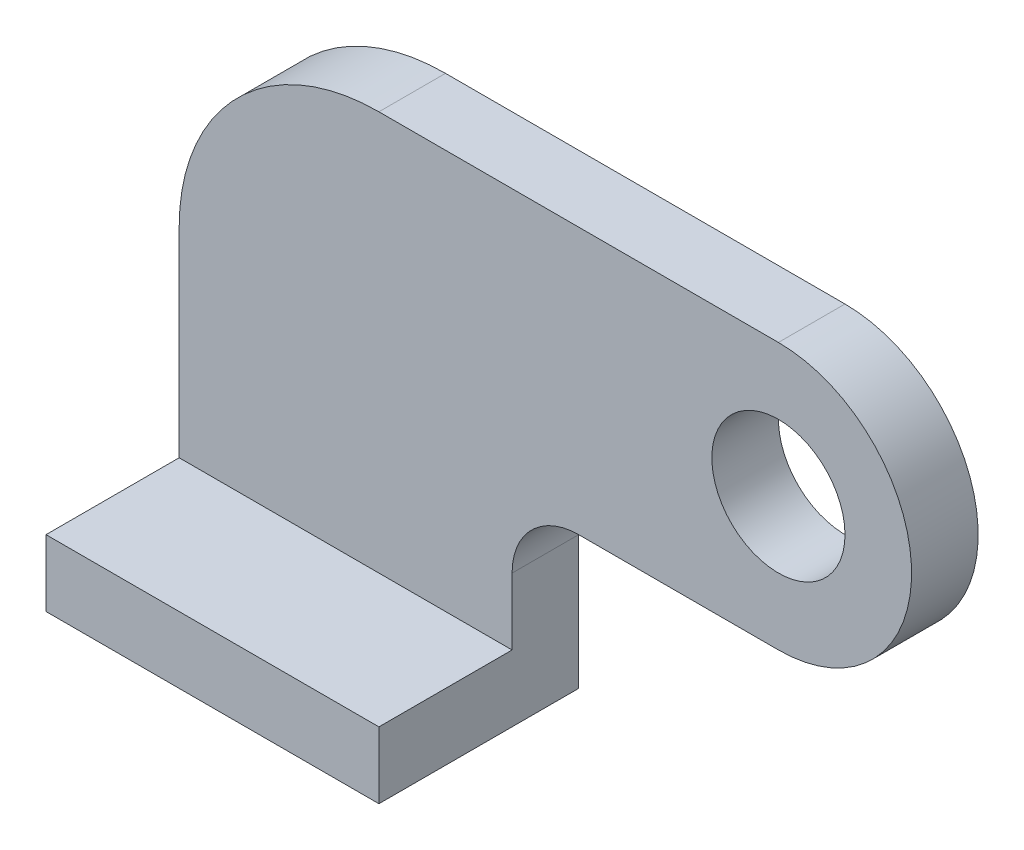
ISO-10303-21;
HEADER;
FILE_DESCRIPTION(('STEP AP214'),'2;1');
FILE_NAME('part.step','',(''),(''),'','','');
FILE_SCHEMA(('AUTOMOTIVE_DESIGN { 1 0 10303 214 1 1 1 1 }'));
ENDSEC;
DATA;
#1=APPLICATION_CONTEXT('core data for automotive mechanical design processes');
#2=APPLICATION_PROTOCOL_DEFINITION('international standard','automotive_design',2000,#1);
#3=PRODUCT_CONTEXT('',#1,'mechanical');
#4=PRODUCT('Part','Part','',(#3));
#5=PRODUCT_RELATED_PRODUCT_CATEGORY('part','',(#4));
#6=PRODUCT_DEFINITION_FORMATION('','',#4);
#7=PRODUCT_DEFINITION_CONTEXT('part definition',#1,'design');
#8=PRODUCT_DEFINITION('design','',#6,#7);
#9=PRODUCT_DEFINITION_SHAPE('','',#8);
#10=(LENGTH_UNIT() NAMED_UNIT(*) SI_UNIT(.MILLI.,.METRE.));
#11=(NAMED_UNIT(*) PLANE_ANGLE_UNIT() SI_UNIT($,.RADIAN.));
#12=(NAMED_UNIT(*) SI_UNIT($,.STERADIAN.) SOLID_ANGLE_UNIT());
#13=UNCERTAINTY_MEASURE_WITH_UNIT(LENGTH_MEASURE(1.E-05),#10,'distance_accuracy_value','');
#14=(GEOMETRIC_REPRESENTATION_CONTEXT(3) GLOBAL_UNCERTAINTY_ASSIGNED_CONTEXT((#13)) GLOBAL_UNIT_ASSIGNED_CONTEXT((#10,
#11,#12)) REPRESENTATION_CONTEXT('',''));
#15=CARTESIAN_POINT('',(0.,0.,0.));
#16=DIRECTION('',(0.,0.,1.));
#17=DIRECTION('',(1.,0.,0.));
#18=AXIS2_PLACEMENT_3D('',#15,#16,#17);
#19=CARTESIAN_POINT('',(0.,0.,38.1));
#20=DIRECTION('',(0.,1.,0.));
#21=DIRECTION('',(0.,0.,1.));
#22=AXIS2_PLACEMENT_3D('',#19,#20,#21);
#23=PLANE('',#22);
#24=DIRECTION('',(1.,0.,0.));
#25=VECTOR('',#24,1.);
#26=CARTESIAN_POINT('',(0.,0.,0.));
#27=LINE('',#26,#25);
#28=CARTESIAN_POINT('',(0.,0.,0.));
#29=VERTEX_POINT('',#28);
#30=CARTESIAN_POINT('',(63.5,0.,0.));
#31=VERTEX_POINT('',#30);
#32=EDGE_CURVE('E143',#29,#31,#27,.T.);
#33=ORIENTED_EDGE('',*,*,#32,.T.);
#34=DIRECTION('',(0.,0.,-1.));
#35=VECTOR('',#34,1.);
#36=CARTESIAN_POINT('',(63.5,0.,38.1));
#37=LINE('',#36,#35);
#38=CARTESIAN_POINT('',(63.5,0.,38.1));
#39=VERTEX_POINT('',#38);
#40=EDGE_CURVE('E11',#39,#31,#37,.T.);
#41=ORIENTED_EDGE('',*,*,#40,.F.);
#42=DIRECTION('',(1.,0.,0.));
#43=VECTOR('',#42,1.);
#44=CARTESIAN_POINT('',(0.,0.,38.1));
#45=LINE('',#44,#43);
#46=CARTESIAN_POINT('',(0.,0.,38.1));
#47=VERTEX_POINT('',#46);
#48=EDGE_CURVE('E184',#47,#39,#45,.T.);
#49=ORIENTED_EDGE('',*,*,#48,.F.);
#50=DIRECTION('',(0.,0.,-1.));
#51=VECTOR('',#50,1.);
#52=CARTESIAN_POINT('',(0.,0.,38.1));
#53=LINE('',#52,#51);
#54=EDGE_CURVE('E59',#47,#29,#53,.T.);
#55=ORIENTED_EDGE('',*,*,#54,.T.);
#56=EDGE_LOOP('',(#33,#41,#49,#55));
#57=FACE_BOUND('',#56,.T.);
#58=ADVANCED_FACE('F34',(#57),#23,.F.);
#59=CARTESIAN_POINT('',(63.5,0.,38.1));
#60=DIRECTION('',(-1.,0.,0.));
#61=DIRECTION('',(0.,0.,1.));
#62=AXIS2_PLACEMENT_3D('',#59,#60,#61);
#63=PLANE('',#62);
#64=DIRECTION('',(0.,1.,0.));
#65=VECTOR('',#64,1.);
#66=CARTESIAN_POINT('',(63.5,0.,0.));
#67=LINE('',#66,#65);
#68=CARTESIAN_POINT('',(63.5,25.3999999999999,0.));
#69=VERTEX_POINT('',#68);
#70=EDGE_CURVE('E194',#31,#69,#67,.T.);
#71=ORIENTED_EDGE('',*,*,#70,.T.);
#72=DIRECTION('',(0.,0.,-1.));
#73=VECTOR('',#72,1.);
#74=CARTESIAN_POINT('',(63.5,25.3999999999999,12.7));
#75=LINE('',#74,#73);
#76=CARTESIAN_POINT('',(63.5,25.3999999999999,12.7));
#77=VERTEX_POINT('',#76);
#78=EDGE_CURVE('E176',#77,#69,#75,.T.);
#79=ORIENTED_EDGE('',*,*,#78,.F.);
#80=DIRECTION('',(0.,1.,0.));
#81=VECTOR('',#80,1.);
#82=CARTESIAN_POINT('',(63.5,0.,12.7));
#83=LINE('',#82,#81);
#84=CARTESIAN_POINT('',(63.5,12.7,12.7));
#85=VERTEX_POINT('',#84);
#86=EDGE_CURVE('E159',#85,#77,#83,.T.);
#87=ORIENTED_EDGE('',*,*,#86,.F.);
#88=DIRECTION('',(0.,0.,-1.));
#89=VECTOR('',#88,1.);
#90=CARTESIAN_POINT('',(63.5,12.7,38.1));
#91=LINE('',#90,#89);
#92=CARTESIAN_POINT('',(63.5,12.7,38.1));
#93=VERTEX_POINT('',#92);
#94=EDGE_CURVE('E42',#93,#85,#91,.T.);
#95=ORIENTED_EDGE('',*,*,#94,.F.);
#96=DIRECTION('',(0.,1.,0.));
#97=VECTOR('',#96,1.);
#98=CARTESIAN_POINT('',(63.5,0.,38.1));
#99=LINE('',#98,#97);
#100=EDGE_CURVE('E78',#39,#93,#99,.T.);
#101=ORIENTED_EDGE('',*,*,#100,.F.);
#102=ORIENTED_EDGE('',*,*,#40,.T.);
#103=EDGE_LOOP('',(#71,#79,#87,#95,#101,#102));
#104=FACE_BOUND('',#103,.T.);
#105=ADVANCED_FACE('F202',(#104),#63,.F.);
#106=CARTESIAN_POINT('',(0.,12.7,38.1));
#107=DIRECTION('',(0.,1.,0.));
#108=DIRECTION('',(0.,0.,1.));
#109=AXIS2_PLACEMENT_3D('',#106,#107,#108);
#110=PLANE('',#109);
#111=DIRECTION('',(1.,0.,0.));
#112=VECTOR('',#111,1.);
#113=CARTESIAN_POINT('',(0.,12.7,12.7));
#114=LINE('',#113,#112);
#115=CARTESIAN_POINT('',(0.,12.7,12.7));
#116=VERTEX_POINT('',#115);
#117=EDGE_CURVE('E50',#116,#85,#114,.T.);
#118=ORIENTED_EDGE('',*,*,#117,.F.);
#119=DIRECTION('',(0.,0.,-1.));
#120=VECTOR('',#119,1.);
#121=CARTESIAN_POINT('',(0.,12.7,38.1));
#122=LINE('',#121,#120);
#123=CARTESIAN_POINT('',(0.,12.7,38.1));
#124=VERTEX_POINT('',#123);
#125=EDGE_CURVE('E170',#124,#116,#122,.T.);
#126=ORIENTED_EDGE('',*,*,#125,.F.);
#127=DIRECTION('',(1.,0.,0.));
#128=VECTOR('',#127,1.);
#129=CARTESIAN_POINT('',(0.,12.7,38.1));
#130=LINE('',#129,#128);
#131=EDGE_CURVE('E188',#124,#93,#130,.T.);
#132=ORIENTED_EDGE('',*,*,#131,.T.);
#133=ORIENTED_EDGE('',*,*,#94,.T.);
#134=EDGE_LOOP('',(#118,#126,#132,#133));
#135=FACE_BOUND('',#134,.T.);
#136=ADVANCED_FACE('F200',(#135),#110,.T.);
#137=CARTESIAN_POINT('',(0.,0.,38.1));
#138=DIRECTION('',(-1.,0.,0.));
#139=DIRECTION('',(0.,0.,1.));
#140=AXIS2_PLACEMENT_3D('',#137,#138,#139);
#141=PLANE('',#140);
#142=DIRECTION('',(0.,1.,0.));
#143=VECTOR('',#142,1.);
#144=CARTESIAN_POINT('',(0.,0.,0.));
#145=LINE('',#144,#143);
#146=CARTESIAN_POINT('',(0.,50.7999999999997,0.));
#147=VERTEX_POINT('',#146);
#148=EDGE_CURVE('E186',#29,#147,#145,.T.);
#149=ORIENTED_EDGE('',*,*,#148,.F.);
#150=ORIENTED_EDGE('',*,*,#54,.F.);
#151=DIRECTION('',(0.,1.,0.));
#152=VECTOR('',#151,1.);
#153=CARTESIAN_POINT('',(0.,0.,38.1));
#154=LINE('',#153,#152);
#155=EDGE_CURVE('E191',#47,#124,#154,.T.);
#156=ORIENTED_EDGE('',*,*,#155,.T.);
#157=ORIENTED_EDGE('',*,*,#125,.T.);
#158=DIRECTION('',(0.,1.,0.));
#159=VECTOR('',#158,1.);
#160=CARTESIAN_POINT('',(0.,0.,12.7));
#161=LINE('',#160,#159);
#162=CARTESIAN_POINT('',(0.,50.7999999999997,12.7));
#163=VERTEX_POINT('',#162);
#164=EDGE_CURVE('E149',#116,#163,#161,.T.);
#165=ORIENTED_EDGE('',*,*,#164,.T.);
#166=DIRECTION('',(0.,0.,-1.));
#167=VECTOR('',#166,1.);
#168=CARTESIAN_POINT('',(0.,50.7999999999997,12.7));
#169=LINE('',#168,#167);
#170=EDGE_CURVE('E168',#163,#147,#169,.T.);
#171=ORIENTED_EDGE('',*,*,#170,.T.);
#172=EDGE_LOOP('',(#149,#150,#156,#157,#165,#171));
#173=FACE_BOUND('',#172,.T.);
#174=ADVANCED_FACE('F167',(#173),#141,.T.);
#175=CARTESIAN_POINT('',(0.,0.,38.1));
#176=DIRECTION('',(0.,0.,1.));
#177=DIRECTION('',(1.,0.,0.));
#178=AXIS2_PLACEMENT_3D('',#175,#176,#177);
#179=PLANE('',#178);
#180=ORIENTED_EDGE('',*,*,#48,.T.);
#181=ORIENTED_EDGE('',*,*,#100,.T.);
#182=ORIENTED_EDGE('',*,*,#131,.F.);
#183=ORIENTED_EDGE('',*,*,#155,.F.);
#184=EDGE_LOOP('',(#180,#181,#182,#183));
#185=FACE_BOUND('',#184,.T.);
#186=ADVANCED_FACE('F234',(#185),#179,.T.);
#187=CARTESIAN_POINT('',(0.,0.,0.));
#188=DIRECTION('',(0.,0.,1.));
#189=DIRECTION('',(1.,0.,0.));
#190=AXIS2_PLACEMENT_3D('',#187,#188,#189);
#191=PLANE('',#190);
#192=ORIENTED_EDGE('',*,*,#32,.F.);
#193=ORIENTED_EDGE('',*,*,#148,.T.);
#194=CARTESIAN_POINT('',(38.1,50.8,0.));
#195=DIRECTION('',(0.,0.,1.));
#196=DIRECTION('',(1.,0.,0.));
#197=AXIS2_PLACEMENT_3D('',#194,#195,#196);
#198=CIRCLE('',#197,38.1);
#199=CARTESIAN_POINT('',(38.1000000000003,88.9,0.));
#200=VERTEX_POINT('',#199);
#201=EDGE_CURVE('E175',#147,#200,#198,.F.);
#202=ORIENTED_EDGE('',*,*,#201,.T.);
#203=DIRECTION('',(1.,0.,0.));
#204=VECTOR('',#203,1.);
#205=CARTESIAN_POINT('',(0.,88.9,0.));
#206=LINE('',#205,#204);
#207=CARTESIAN_POINT('',(114.3,88.9,0.));
#208=VERTEX_POINT('',#207);
#209=EDGE_CURVE('E220',#200,#208,#206,.T.);
#210=ORIENTED_EDGE('',*,*,#209,.T.);
#211=CARTESIAN_POINT('',(114.3,63.5,0.));
#212=DIRECTION('',(0.,0.,1.));
#213=DIRECTION('',(1.,0.,0.));
#214=AXIS2_PLACEMENT_3D('',#211,#212,#213);
#215=CIRCLE('',#214,25.4);
#216=CARTESIAN_POINT('',(114.3,38.1,0.));
#217=VERTEX_POINT('',#216);
#218=EDGE_CURVE('E139',#217,#208,#215,.T.);
#219=ORIENTED_EDGE('',*,*,#218,.F.);
#220=DIRECTION('',(1.,0.,0.));
#221=VECTOR('',#220,1.);
#222=CARTESIAN_POINT('',(0.,38.1,0.));
#223=LINE('',#222,#221);
#224=CARTESIAN_POINT('',(76.2000000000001,38.1,0.));
#225=VERTEX_POINT('',#224);
#226=EDGE_CURVE('E224',#225,#217,#223,.T.);
#227=ORIENTED_EDGE('',*,*,#226,.F.);
#228=CARTESIAN_POINT('',(76.2,25.4,0.));
#229=DIRECTION('',(0.,0.,1.));
#230=DIRECTION('',(1.,0.,0.));
#231=AXIS2_PLACEMENT_3D('',#228,#229,#230);
#232=CIRCLE('',#231,12.7);
#233=EDGE_CURVE('E210',#69,#225,#232,.F.);
#234=ORIENTED_EDGE('',*,*,#233,.F.);
#235=ORIENTED_EDGE('',*,*,#70,.F.);
#236=EDGE_LOOP('',(#192,#193,#202,#210,#219,#227,#234,#235));
#237=FACE_BOUND('',#236,.T.);
#238=CARTESIAN_POINT('',(114.3,63.5,0.));
#239=DIRECTION('',(0.,0.,1.));
#240=DIRECTION('',(1.,0.,0.));
#241=AXIS2_PLACEMENT_3D('',#238,#239,#240);
#242=CIRCLE('',#241,12.7);
#243=CARTESIAN_POINT('',(127.,63.5,0.));
#244=VERTEX_POINT('',#243);
#245=EDGE_CURVE('E133',#244,#244,#242,.T.);
#246=ORIENTED_EDGE('',*,*,#245,.T.);
#247=EDGE_LOOP('',(#246));
#248=FACE_BOUND('',#247,.T.);
#249=ADVANCED_FACE('F229',(#237,#248),#191,.F.);
#250=CARTESIAN_POINT('',(114.3,63.5,12.7));
#251=DIRECTION('',(0.,0.,-1.));
#252=DIRECTION('',(-1.,0.,0.));
#253=AXIS2_PLACEMENT_3D('',#250,#251,#252);
#254=CYLINDRICAL_SURFACE('',#253,25.4);
#255=ORIENTED_EDGE('',*,*,#218,.T.);
#256=DIRECTION('',(0.,0.,-1.));
#257=VECTOR('',#256,1.);
#258=CARTESIAN_POINT('',(114.3,88.9,12.7));
#259=LINE('',#258,#257);
#260=CARTESIAN_POINT('',(114.3,88.9,12.7));
#261=VERTEX_POINT('',#260);
#262=EDGE_CURVE('E136',#261,#208,#259,.T.);
#263=ORIENTED_EDGE('',*,*,#262,.F.);
#264=CARTESIAN_POINT('',(114.3,63.5,12.7));
#265=DIRECTION('',(0.,0.,1.));
#266=DIRECTION('',(1.,0.,0.));
#267=AXIS2_PLACEMENT_3D('',#264,#265,#266);
#268=CIRCLE('',#267,25.4);
#269=CARTESIAN_POINT('',(114.3,38.1,12.7));
#270=VERTEX_POINT('',#269);
#271=EDGE_CURVE('E120',#270,#261,#268,.T.);
#272=ORIENTED_EDGE('',*,*,#271,.F.);
#273=DIRECTION('',(0.,0.,-1.));
#274=VECTOR('',#273,1.);
#275=CARTESIAN_POINT('',(114.3,38.1,12.7));
#276=LINE('',#275,#274);
#277=EDGE_CURVE('E213',#270,#217,#276,.T.);
#278=ORIENTED_EDGE('',*,*,#277,.T.);
#279=EDGE_LOOP('',(#255,#263,#272,#278));
#280=FACE_BOUND('',#279,.T.);
#281=ADVANCED_FACE('F137',(#280),#254,.T.);
#282=CARTESIAN_POINT('',(0.,88.9,12.7));
#283=DIRECTION('',(0.,1.,0.));
#284=DIRECTION('',(-1.,0.,0.));
#285=AXIS2_PLACEMENT_3D('',#282,#283,#284);
#286=PLANE('',#285);
#287=ORIENTED_EDGE('',*,*,#209,.F.);
#288=DIRECTION('',(0.,0.,-1.));
#289=VECTOR('',#288,1.);
#290=CARTESIAN_POINT('',(38.1000000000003,88.9,12.7));
#291=LINE('',#290,#289);
#292=CARTESIAN_POINT('',(38.1000000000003,88.9,12.7));
#293=VERTEX_POINT('',#292);
#294=EDGE_CURVE('E144',#293,#200,#291,.T.);
#295=ORIENTED_EDGE('',*,*,#294,.F.);
#296=DIRECTION('',(1.,0.,0.));
#297=VECTOR('',#296,1.);
#298=CARTESIAN_POINT('',(0.,88.9,12.7));
#299=LINE('',#298,#297);
#300=EDGE_CURVE('E126',#293,#261,#299,.T.);
#301=ORIENTED_EDGE('',*,*,#300,.T.);
#302=ORIENTED_EDGE('',*,*,#262,.T.);
#303=EDGE_LOOP('',(#287,#295,#301,#302));
#304=FACE_BOUND('',#303,.T.);
#305=ADVANCED_FACE('F146',(#304),#286,.T.);
#306=CARTESIAN_POINT('',(38.1,50.8,12.7));
#307=DIRECTION('',(0.,0.,-1.));
#308=DIRECTION('',(-1.,0.,0.));
#309=AXIS2_PLACEMENT_3D('',#306,#307,#308);
#310=CYLINDRICAL_SURFACE('',#309,38.1);
#311=ORIENTED_EDGE('',*,*,#201,.F.);
#312=ORIENTED_EDGE('',*,*,#170,.F.);
#313=CARTESIAN_POINT('',(38.1,50.8,12.7));
#314=DIRECTION('',(0.,0.,1.));
#315=DIRECTION('',(1.,0.,0.));
#316=AXIS2_PLACEMENT_3D('',#313,#314,#315);
#317=CIRCLE('',#316,38.1);
#318=EDGE_CURVE('E147',#163,#293,#317,.F.);
#319=ORIENTED_EDGE('',*,*,#318,.T.);
#320=ORIENTED_EDGE('',*,*,#294,.T.);
#321=EDGE_LOOP('',(#311,#312,#319,#320));
#322=FACE_BOUND('',#321,.T.);
#323=ADVANCED_FACE('F173',(#322),#310,.T.);
#324=CARTESIAN_POINT('',(76.2,25.4,12.7));
#325=DIRECTION('',(0.,0.,-1.));
#326=DIRECTION('',(-1.,0.,0.));
#327=AXIS2_PLACEMENT_3D('',#324,#325,#326);
#328=CYLINDRICAL_SURFACE('',#327,12.7);
#329=ORIENTED_EDGE('',*,*,#233,.T.);
#330=DIRECTION('',(0.,0.,-1.));
#331=VECTOR('',#330,1.);
#332=CARTESIAN_POINT('',(76.2000000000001,38.1,12.7));
#333=LINE('',#332,#331);
#334=CARTESIAN_POINT('',(76.2000000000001,38.1,12.7));
#335=VERTEX_POINT('',#334);
#336=EDGE_CURVE('E180',#335,#225,#333,.T.);
#337=ORIENTED_EDGE('',*,*,#336,.F.);
#338=CARTESIAN_POINT('',(76.2,25.4,12.7));
#339=DIRECTION('',(0.,0.,1.));
#340=DIRECTION('',(1.,0.,0.));
#341=AXIS2_PLACEMENT_3D('',#338,#339,#340);
#342=CIRCLE('',#341,12.7);
#343=EDGE_CURVE('E154',#77,#335,#342,.F.);
#344=ORIENTED_EDGE('',*,*,#343,.F.);
#345=ORIENTED_EDGE('',*,*,#78,.T.);
#346=EDGE_LOOP('',(#329,#337,#344,#345));
#347=FACE_BOUND('',#346,.T.);
#348=ADVANCED_FACE('F208',(#347),#328,.F.);
#349=CARTESIAN_POINT('',(0.,38.1,12.7));
#350=DIRECTION('',(0.,1.,0.));
#351=DIRECTION('',(0.,0.,1.));
#352=AXIS2_PLACEMENT_3D('',#349,#350,#351);
#353=PLANE('',#352);
#354=ORIENTED_EDGE('',*,*,#226,.T.);
#355=ORIENTED_EDGE('',*,*,#277,.F.);
#356=DIRECTION('',(1.,0.,0.));
#357=VECTOR('',#356,1.);
#358=CARTESIAN_POINT('',(0.,38.1,12.7));
#359=LINE('',#358,#357);
#360=EDGE_CURVE('E129',#335,#270,#359,.T.);
#361=ORIENTED_EDGE('',*,*,#360,.F.);
#362=ORIENTED_EDGE('',*,*,#336,.T.);
#363=EDGE_LOOP('',(#354,#355,#361,#362));
#364=FACE_BOUND('',#363,.T.);
#365=ADVANCED_FACE('F214',(#364),#353,.F.);
#366=CARTESIAN_POINT('',(114.3,63.5,12.7));
#367=DIRECTION('',(0.,0.,-1.));
#368=DIRECTION('',(-1.,0.,0.));
#369=AXIS2_PLACEMENT_3D('',#366,#367,#368);
#370=CYLINDRICAL_SURFACE('',#369,12.7);
#371=CARTESIAN_POINT('',(114.3,63.5,12.7));
#372=DIRECTION('',(0.,0.,1.));
#373=DIRECTION('',(1.,0.,0.));
#374=AXIS2_PLACEMENT_3D('',#371,#372,#373);
#375=CIRCLE('',#374,12.7);
#376=CARTESIAN_POINT('',(127.,63.5,12.7));
#377=VERTEX_POINT('',#376);
#378=EDGE_CURVE('E215',#377,#377,#375,.T.);
#379=ORIENTED_EDGE('',*,*,#378,.T.);
#380=EDGE_LOOP('',(#379));
#381=FACE_BOUND('',#380,.T.);
#382=ORIENTED_EDGE('',*,*,#245,.F.);
#383=EDGE_LOOP('',(#382));
#384=FACE_BOUND('',#383,.T.);
#385=ADVANCED_FACE('F308',(#381,#384),#370,.F.);
#386=CARTESIAN_POINT('',(0.,0.,12.7));
#387=DIRECTION('',(0.,0.,1.));
#388=DIRECTION('',(1.,0.,0.));
#389=AXIS2_PLACEMENT_3D('',#386,#387,#388);
#390=PLANE('',#389);
#391=ORIENTED_EDGE('',*,*,#271,.T.);
#392=ORIENTED_EDGE('',*,*,#300,.F.);
#393=ORIENTED_EDGE('',*,*,#318,.F.);
#394=ORIENTED_EDGE('',*,*,#164,.F.);
#395=ORIENTED_EDGE('',*,*,#117,.T.);
#396=ORIENTED_EDGE('',*,*,#86,.T.);
#397=ORIENTED_EDGE('',*,*,#343,.T.);
#398=ORIENTED_EDGE('',*,*,#360,.T.);
#399=EDGE_LOOP('',(#391,#392,#393,#394,#395,#396,#397,#398));
#400=FACE_BOUND('',#399,.T.);
#401=ORIENTED_EDGE('',*,*,#378,.F.);
#402=EDGE_LOOP('',(#401));
#403=FACE_BOUND('',#402,.T.);
#404=ADVANCED_FACE('F122',(#400,#403),#390,.T.);
#405=CLOSED_SHELL('',(#58,#105,#136,#174,#186,#249,#281,#305,#323,#348,#365,#385,#404));
#406=MANIFOLD_SOLID_BREP('B2',#405);
#407=ADVANCED_BREP_SHAPE_REPRESENTATION('',(#18,#406),#14);
#408=SHAPE_DEFINITION_REPRESENTATION(#9,#407);
ENDSEC;
END-ISO-10303-21;
